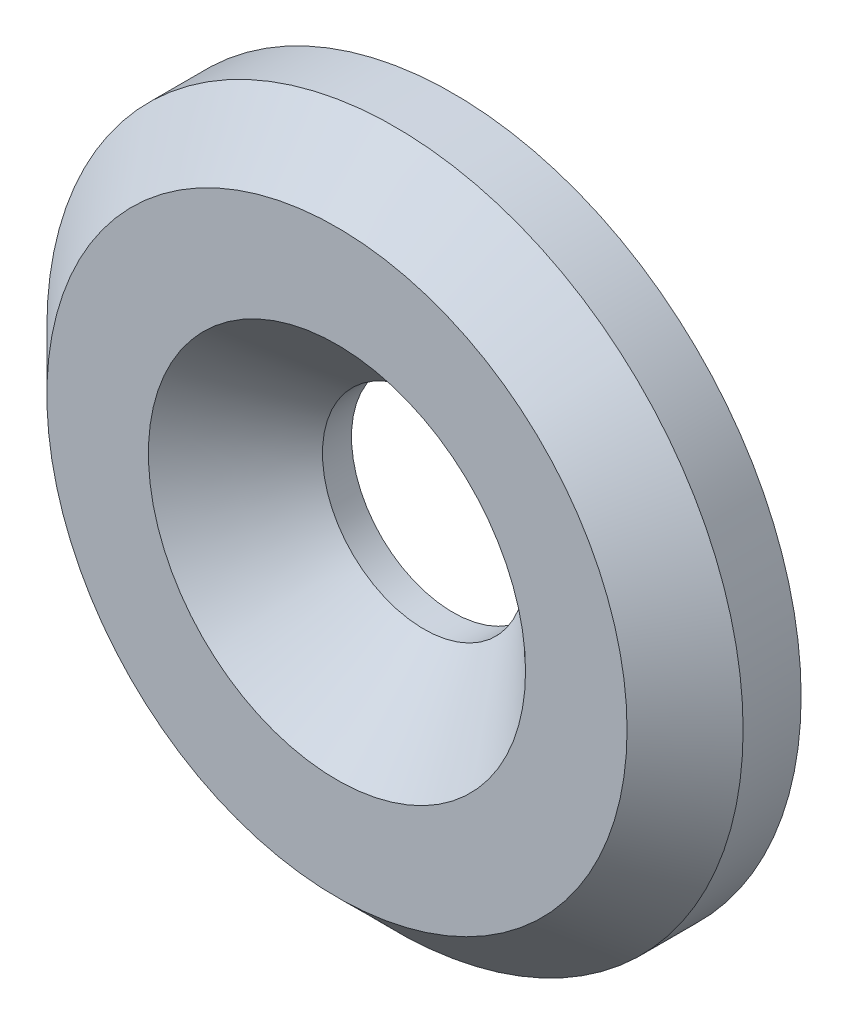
from build123d import *

# Parameters (mm, degrees)
ESQUISSE1_R        = 6
ESQUISSE1_R_2      = 1.75
BOSS_EXTRU_1_DEPTH = 2
CHANFREIN1_SIZE    = 1
CHANFREIN3_SIZE    = 1.5


with BuildPart() as part:
    # Esquisse1 → Boss.-Extru.1 (new body)
    with BuildSketch(Plane.XY):
        Circle(ESQUISSE1_R)
        Circle(ESQUISSE1_R_2, mode=Mode.SUBTRACT)
    extrude(amount=BOSS_EXTRU_1_DEPTH)

    # Chanfrein1
    chanfrein1_edges = [part.edges().sort_by_distance(p)[0] for p in [
        (-6, 0, 2),
    ]]
    chamfer(chanfrein1_edges, length=CHANFREIN1_SIZE)

    # Chanfrein3
    chanfrein3_edges = [part.edges().sort_by_distance(p)[0] for p in [
        (-1.75, 0, 2),
    ]]
    chamfer(chanfrein3_edges, length=CHANFREIN3_SIZE)


solid = part.part
